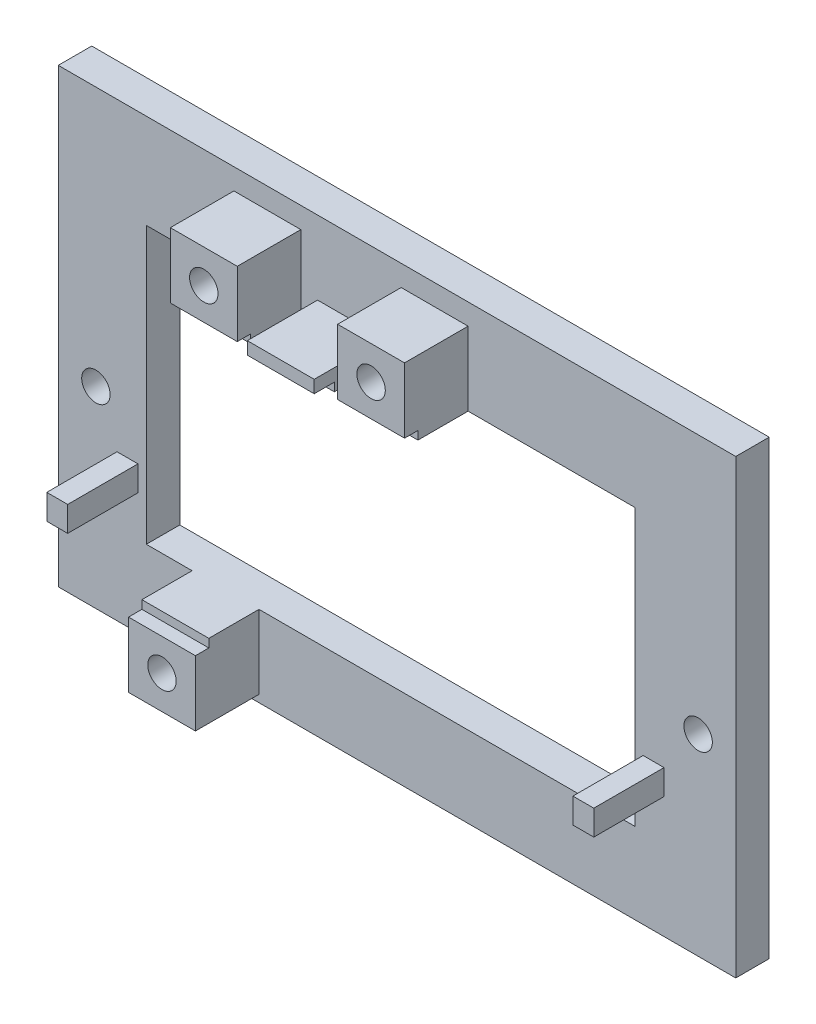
ISO-10303-21;
HEADER;
FILE_DESCRIPTION(('STEP AP214'),'2;1');
FILE_NAME('part.step','',(''),(''),'','','');
FILE_SCHEMA(('AUTOMOTIVE_DESIGN { 1 0 10303 214 1 1 1 1 }'));
ENDSEC;
DATA;
#1=APPLICATION_CONTEXT('core data for automotive mechanical design processes');
#2=APPLICATION_PROTOCOL_DEFINITION('international standard','automotive_design',2000,#1);
#3=PRODUCT_CONTEXT('',#1,'mechanical');
#4=PRODUCT('Part','Part','',(#3));
#5=PRODUCT_RELATED_PRODUCT_CATEGORY('part','',(#4));
#6=PRODUCT_DEFINITION_FORMATION('','',#4);
#7=PRODUCT_DEFINITION_CONTEXT('part definition',#1,'design');
#8=PRODUCT_DEFINITION('design','',#6,#7);
#9=PRODUCT_DEFINITION_SHAPE('','',#8);
#10=(LENGTH_UNIT() NAMED_UNIT(*) SI_UNIT(.MILLI.,.METRE.));
#11=(NAMED_UNIT(*) PLANE_ANGLE_UNIT() SI_UNIT($,.RADIAN.));
#12=(NAMED_UNIT(*) SI_UNIT($,.STERADIAN.) SOLID_ANGLE_UNIT());
#13=UNCERTAINTY_MEASURE_WITH_UNIT(LENGTH_MEASURE(1.E-05),#10,'distance_accuracy_value','');
#14=(GEOMETRIC_REPRESENTATION_CONTEXT(3) GLOBAL_UNCERTAINTY_ASSIGNED_CONTEXT((#13)) GLOBAL_UNIT_ASSIGNED_CONTEXT((#10,
#11,#12)) REPRESENTATION_CONTEXT('',''));
#15=CARTESIAN_POINT('',(0.,0.,0.));
#16=DIRECTION('',(0.,0.,1.));
#17=DIRECTION('',(1.,0.,0.));
#18=AXIS2_PLACEMENT_3D('',#15,#16,#17);
#19=CARTESIAN_POINT('',(0.,0.,4.));
#20=DIRECTION('',(0.,0.,1.));
#21=DIRECTION('',(1.,0.,0.));
#22=AXIS2_PLACEMENT_3D('',#19,#20,#21);
#23=PLANE('',#22);
#24=DIRECTION('',(0.,-1.,0.));
#25=VECTOR('',#24,1.);
#26=CARTESIAN_POINT('',(-19.,-9.32800108,4.));
#27=LINE('',#26,#25);
#28=CARTESIAN_POINT('',(-19.,-9.32800108,4.));
#29=VERTEX_POINT('',#28);
#30=CARTESIAN_POINT('',(-19.,-18.12800108,4.));
#31=VERTEX_POINT('',#30);
#32=EDGE_CURVE('E479',#29,#31,#27,.T.);
#33=ORIENTED_EDGE('',*,*,#32,.F.);
#34=DIRECTION('',(1.,0.,0.));
#35=VECTOR('',#34,1.);
#36=CARTESIAN_POINT('',(-24.473,-9.32800108,4.));
#37=LINE('',#36,#35);
#38=CARTESIAN_POINT('',(-24.473,-9.32800108,4.));
#39=VERTEX_POINT('',#38);
#40=EDGE_CURVE('E579',#39,#29,#37,.T.);
#41=ORIENTED_EDGE('',*,*,#40,.F.);
#42=DIRECTION('',(0.,-1.,0.));
#43=VECTOR('',#42,1.);
#44=CARTESIAN_POINT('',(-24.473,23.69100004,4.));
#45=LINE('',#44,#43);
#46=CARTESIAN_POINT('',(-24.473,23.69100004,4.));
#47=VERTEX_POINT('',#46);
#48=EDGE_CURVE('E575',#47,#39,#45,.T.);
#49=ORIENTED_EDGE('',*,*,#48,.F.);
#50=DIRECTION('',(-1.,0.,0.));
#51=VECTOR('',#50,1.);
#52=CARTESIAN_POINT('',(33.92699938,23.69100004,4.));
#53=LINE('',#52,#51);
#54=CARTESIAN_POINT('',(-14.,23.69100004,4.));
#55=VERTEX_POINT('',#54);
#56=EDGE_CURVE('E585',#55,#47,#53,.T.);
#57=ORIENTED_EDGE('',*,*,#56,.F.);
#58=DIRECTION('',(0.,-1.,0.));
#59=VECTOR('',#58,1.);
#60=CARTESIAN_POINT('',(-14.,32.49100004,4.));
#61=LINE('',#60,#59);
#62=CARTESIAN_POINT('',(-14.,32.49100004,4.));
#63=VERTEX_POINT('',#62);
#64=EDGE_CURVE('E470',#63,#55,#61,.T.);
#65=ORIENTED_EDGE('',*,*,#64,.F.);
#66=DIRECTION('',(-1.,0.,0.));
#67=VECTOR('',#66,1.);
#68=CARTESIAN_POINT('',(-6.,32.49100004,4.));
#69=LINE('',#68,#67);
#70=CARTESIAN_POINT('',(-6.,32.49100004,4.));
#71=VERTEX_POINT('',#70);
#72=EDGE_CURVE('E530',#71,#63,#69,.T.);
#73=ORIENTED_EDGE('',*,*,#72,.F.);
#74=DIRECTION('',(0.,1.,0.));
#75=VECTOR('',#74,1.);
#76=CARTESIAN_POINT('',(-6.,23.69100004,4.));
#77=LINE('',#76,#75);
#78=CARTESIAN_POINT('',(-6.,23.69100004,4.));
#79=VERTEX_POINT('',#78);
#80=EDGE_CURVE('E537',#79,#71,#77,.T.);
#81=ORIENTED_EDGE('',*,*,#80,.F.);
#82=CARTESIAN_POINT('',(-4.,23.69100004,4.));
#83=VERTEX_POINT('',#82);
#84=EDGE_CURVE('E1154',#83,#79,#53,.T.);
#85=ORIENTED_EDGE('',*,*,#84,.F.);
#86=DIRECTION('',(0.,-1.,0.));
#87=VECTOR('',#86,1.);
#88=CARTESIAN_POINT('',(-4.,26.19100004,4.));
#89=LINE('',#88,#87);
#90=CARTESIAN_POINT('',(-4.,26.19100004,4.));
#91=VERTEX_POINT('',#90);
#92=EDGE_CURVE('E450',#91,#83,#89,.T.);
#93=ORIENTED_EDGE('',*,*,#92,.F.);
#94=DIRECTION('',(-1.,0.,0.));
#95=VECTOR('',#94,1.);
#96=CARTESIAN_POINT('',(4.,26.19100004,4.));
#97=LINE('',#96,#95);
#98=CARTESIAN_POINT('',(4.,26.19100004,4.));
#99=VERTEX_POINT('',#98);
#100=EDGE_CURVE('E489',#99,#91,#97,.T.);
#101=ORIENTED_EDGE('',*,*,#100,.F.);
#102=DIRECTION('',(0.,1.,0.));
#103=VECTOR('',#102,1.);
#104=CARTESIAN_POINT('',(4.,23.69100004,4.));
#105=LINE('',#104,#103);
#106=CARTESIAN_POINT('',(4.,23.69100004,4.));
#107=VERTEX_POINT('',#106);
#108=EDGE_CURVE('E492',#107,#99,#105,.T.);
#109=ORIENTED_EDGE('',*,*,#108,.F.);
#110=CARTESIAN_POINT('',(6.,23.69100004,4.));
#111=VERTEX_POINT('',#110);
#112=EDGE_CURVE('E590',#111,#107,#53,.T.);
#113=ORIENTED_EDGE('',*,*,#112,.F.);
#114=DIRECTION('',(0.,-1.,0.));
#115=VECTOR('',#114,1.);
#116=CARTESIAN_POINT('',(6.,32.49100004,4.));
#117=LINE('',#116,#115);
#118=CARTESIAN_POINT('',(6.,32.49100004,4.));
#119=VERTEX_POINT('',#118);
#120=EDGE_CURVE('E467',#119,#111,#117,.T.);
#121=ORIENTED_EDGE('',*,*,#120,.F.);
#122=DIRECTION('',(-1.,0.,0.));
#123=VECTOR('',#122,1.);
#124=CARTESIAN_POINT('',(14.,32.49100004,4.));
#125=LINE('',#124,#123);
#126=CARTESIAN_POINT('',(14.,32.49100004,4.));
#127=VERTEX_POINT('',#126);
#128=EDGE_CURVE('E460',#127,#119,#125,.T.);
#129=ORIENTED_EDGE('',*,*,#128,.F.);
#130=DIRECTION('',(0.,1.,0.));
#131=VECTOR('',#130,1.);
#132=CARTESIAN_POINT('',(14.,23.69100004,4.));
#133=LINE('',#132,#131);
#134=CARTESIAN_POINT('',(14.,23.69100004,4.));
#135=VERTEX_POINT('',#134);
#136=EDGE_CURVE('E463',#135,#127,#133,.T.);
#137=ORIENTED_EDGE('',*,*,#136,.F.);
#138=CARTESIAN_POINT('',(33.92699938,23.69100004,4.));
#139=VERTEX_POINT('',#138);
#140=EDGE_CURVE('E586',#139,#135,#53,.T.);
#141=ORIENTED_EDGE('',*,*,#140,.F.);
#142=DIRECTION('',(0.,1.,0.));
#143=VECTOR('',#142,1.);
#144=CARTESIAN_POINT('',(33.92699938,-9.32800108,4.));
#145=LINE('',#144,#143);
#146=CARTESIAN_POINT('',(33.92699938,-9.32800108,4.));
#147=VERTEX_POINT('',#146);
#148=EDGE_CURVE('E582',#147,#139,#145,.T.);
#149=ORIENTED_EDGE('',*,*,#148,.F.);
#150=CARTESIAN_POINT('',(-11.,-9.32800108,4.));
#151=VERTEX_POINT('',#150);
#152=EDGE_CURVE('E577',#151,#147,#37,.T.);
#153=ORIENTED_EDGE('',*,*,#152,.F.);
#154=DIRECTION('',(0.,1.,0.));
#155=VECTOR('',#154,1.);
#156=CARTESIAN_POINT('',(-11.,-18.12800108,4.));
#157=LINE('',#156,#155);
#158=CARTESIAN_POINT('',(-11.,-18.12800108,4.));
#159=VERTEX_POINT('',#158);
#160=EDGE_CURVE('E514',#159,#151,#157,.T.);
#161=ORIENTED_EDGE('',*,*,#160,.F.);
#162=DIRECTION('',(1.,0.,0.));
#163=VECTOR('',#162,1.);
#164=CARTESIAN_POINT('',(-19.,-18.12800108,4.));
#165=LINE('',#164,#163);
#166=EDGE_CURVE('E517',#31,#159,#165,.T.);
#167=ORIENTED_EDGE('',*,*,#166,.F.);
#168=EDGE_LOOP('',(#33,#41,#49,#57,#65,#73,#81,#85,#93,#101,#109,#113,#121,#129,#137,#141,#149,
#153,#161,#167));
#169=FACE_BOUND('',#168,.T.);
#170=CARTESIAN_POINT('',(41.5,4.,4.));
#171=DIRECTION('',(0.,0.,1.));
#172=DIRECTION('',(1.,0.,0.));
#173=AXIS2_PLACEMENT_3D('',#170,#171,#172);
#174=CIRCLE('',#173,1.7);
#175=CARTESIAN_POINT('',(43.2,4.,4.));
#176=VERTEX_POINT('',#175);
#177=EDGE_CURVE('E563',#176,#176,#174,.T.);
#178=ORIENTED_EDGE('',*,*,#177,.F.);
#179=EDGE_LOOP('',(#178));
#180=FACE_BOUND('',#179,.T.);
#181=DIRECTION('',(0.,-1.,0.));
#182=VECTOR('',#181,1.);
#183=CARTESIAN_POINT('',(-35.,35.,4.));
#184=LINE('',#183,#182);
#185=CARTESIAN_POINT('',(-35.,35.,4.));
#186=VERTEX_POINT('',#185);
#187=CARTESIAN_POINT('',(-35.,-19.,4.));
#188=VERTEX_POINT('',#187);
#189=EDGE_CURVE('E611',#186,#188,#184,.T.);
#190=ORIENTED_EDGE('',*,*,#189,.T.);
#191=DIRECTION('',(1.,0.,0.));
#192=VECTOR('',#191,1.);
#193=CARTESIAN_POINT('',(-35.,-19.,4.));
#194=LINE('',#193,#192);
#195=CARTESIAN_POINT('',(46.,-19.,4.));
#196=VERTEX_POINT('',#195);
#197=EDGE_CURVE('E614',#188,#196,#194,.T.);
#198=ORIENTED_EDGE('',*,*,#197,.T.);
#199=DIRECTION('',(0.,1.,0.));
#200=VECTOR('',#199,1.);
#201=CARTESIAN_POINT('',(46.,-19.,4.));
#202=LINE('',#201,#200);
#203=CARTESIAN_POINT('',(46.,35.,4.));
#204=VERTEX_POINT('',#203);
#205=EDGE_CURVE('E617',#196,#204,#202,.T.);
#206=ORIENTED_EDGE('',*,*,#205,.T.);
#207=DIRECTION('',(-1.,0.,0.));
#208=VECTOR('',#207,1.);
#209=CARTESIAN_POINT('',(46.,35.,4.));
#210=LINE('',#209,#208);
#211=EDGE_CURVE('E619',#204,#186,#210,.T.);
#212=ORIENTED_EDGE('',*,*,#211,.T.);
#213=EDGE_LOOP('',(#190,#198,#206,#212));
#214=FACE_BOUND('',#213,.T.);
#215=CARTESIAN_POINT('',(-30.5,4.,4.));
#216=DIRECTION('',(0.,0.,1.));
#217=DIRECTION('',(1.,0.,0.));
#218=AXIS2_PLACEMENT_3D('',#215,#216,#217);
#219=CIRCLE('',#218,1.7);
#220=CARTESIAN_POINT('',(-28.8,4.,4.));
#221=VERTEX_POINT('',#220);
#222=EDGE_CURVE('E569',#221,#221,#219,.T.);
#223=ORIENTED_EDGE('',*,*,#222,.F.);
#224=EDGE_LOOP('',(#223));
#225=FACE_BOUND('',#224,.T.);
#226=DIRECTION('',(1.,0.,0.));
#227=VECTOR('',#226,1.);
#228=CARTESIAN_POINT('',(34.92699938,-4.5,4.));
#229=LINE('',#228,#227);
#230=CARTESIAN_POINT('',(34.92699938,-4.5,4.));
#231=VERTEX_POINT('',#230);
#232=CARTESIAN_POINT('',(37.42699938,-4.5,4.));
#233=VERTEX_POINT('',#232);
#234=EDGE_CURVE('E349',#231,#233,#229,.T.);
#235=ORIENTED_EDGE('',*,*,#234,.F.);
#236=DIRECTION('',(0.,-1.,0.));
#237=VECTOR('',#236,1.);
#238=CARTESIAN_POINT('',(34.92699938,-1.5,4.));
#239=LINE('',#238,#237);
#240=CARTESIAN_POINT('',(34.92699938,-1.5,4.));
#241=VERTEX_POINT('',#240);
#242=EDGE_CURVE('E351',#241,#231,#239,.T.);
#243=ORIENTED_EDGE('',*,*,#242,.F.);
#244=DIRECTION('',(-1.,0.,0.));
#245=VECTOR('',#244,1.);
#246=CARTESIAN_POINT('',(37.42699938,-1.5,4.));
#247=LINE('',#246,#245);
#248=CARTESIAN_POINT('',(37.42699938,-1.5,4.));
#249=VERTEX_POINT('',#248);
#250=EDGE_CURVE('E344',#249,#241,#247,.T.);
#251=ORIENTED_EDGE('',*,*,#250,.F.);
#252=DIRECTION('',(0.,1.,0.));
#253=VECTOR('',#252,1.);
#254=CARTESIAN_POINT('',(37.42699938,-4.5,4.));
#255=LINE('',#254,#253);
#256=EDGE_CURVE('E346',#233,#249,#255,.T.);
#257=ORIENTED_EDGE('',*,*,#256,.F.);
#258=EDGE_LOOP('',(#235,#243,#251,#257));
#259=FACE_BOUND('',#258,.T.);
#260=DIRECTION('',(1.,0.,0.));
#261=VECTOR('',#260,1.);
#262=CARTESIAN_POINT('',(-27.973,-4.5,4.));
#263=LINE('',#262,#261);
#264=CARTESIAN_POINT('',(-27.973,-4.5,4.));
#265=VERTEX_POINT('',#264);
#266=CARTESIAN_POINT('',(-25.473,-4.5,4.));
#267=VERTEX_POINT('',#266);
#268=EDGE_CURVE('E1260',#265,#267,#263,.T.);
#269=ORIENTED_EDGE('',*,*,#268,.F.);
#270=DIRECTION('',(0.,-1.,0.));
#271=VECTOR('',#270,1.);
#272=CARTESIAN_POINT('',(-27.973,-1.5,4.));
#273=LINE('',#272,#271);
#274=CARTESIAN_POINT('',(-27.973,-1.5,4.));
#275=VERTEX_POINT('',#274);
#276=EDGE_CURVE('E324',#275,#265,#273,.T.);
#277=ORIENTED_EDGE('',*,*,#276,.F.);
#278=DIRECTION('',(-1.,0.,0.));
#279=VECTOR('',#278,1.);
#280=CARTESIAN_POINT('',(-25.473,-1.5,4.));
#281=LINE('',#280,#279);
#282=CARTESIAN_POINT('',(-25.473,-1.5,4.));
#283=VERTEX_POINT('',#282);
#284=EDGE_CURVE('E320',#283,#275,#281,.T.);
#285=ORIENTED_EDGE('',*,*,#284,.F.);
#286=DIRECTION('',(0.,1.,0.));
#287=VECTOR('',#286,1.);
#288=CARTESIAN_POINT('',(-25.473,-4.5,4.));
#289=LINE('',#288,#287);
#290=EDGE_CURVE('E1257',#267,#283,#289,.T.);
#291=ORIENTED_EDGE('',*,*,#290,.F.);
#292=EDGE_LOOP('',(#269,#277,#285,#291));
#293=FACE_BOUND('',#292,.T.);
#294=ADVANCED_FACE('F43',(#169,#180,#214,#225,#259,#293),#23,.T.);
#295=CARTESIAN_POINT('',(0.,0.,10.));
#296=DIRECTION('',(0.,0.,1.));
#297=DIRECTION('',(1.,0.,0.));
#298=AXIS2_PLACEMENT_3D('',#295,#296,#297);
#299=PLANE('',#298);
#300=DIRECTION('',(0.,1.,0.));
#301=VECTOR('',#300,1.);
#302=CARTESIAN_POINT('',(4.,23.69100004,10.));
#303=LINE('',#302,#301);
#304=CARTESIAN_POINT('',(4.,23.69100004,10.));
#305=VERTEX_POINT('',#304);
#306=CARTESIAN_POINT('',(4.,24.69100004,10.));
#307=VERTEX_POINT('',#306);
#308=EDGE_CURVE('E488',#305,#307,#303,.T.);
#309=ORIENTED_EDGE('',*,*,#308,.T.);
#310=DIRECTION('',(1.,0.,0.));
#311=VECTOR('',#310,1.);
#312=CARTESIAN_POINT('',(-4.,24.69100004,10.));
#313=LINE('',#312,#311);
#314=CARTESIAN_POINT('',(-4.,24.69100004,10.));
#315=VERTEX_POINT('',#314);
#316=EDGE_CURVE('E326',#315,#307,#313,.T.);
#317=ORIENTED_EDGE('',*,*,#316,.F.);
#318=DIRECTION('',(0.,-1.,0.));
#319=VECTOR('',#318,1.);
#320=CARTESIAN_POINT('',(-4.,26.19100004,10.));
#321=LINE('',#320,#319);
#322=CARTESIAN_POINT('',(-4.,23.69100004,10.));
#323=VERTEX_POINT('',#322);
#324=EDGE_CURVE('E493',#315,#323,#321,.T.);
#325=ORIENTED_EDGE('',*,*,#324,.T.);
#326=DIRECTION('',(1.,0.,0.));
#327=VECTOR('',#326,1.);
#328=CARTESIAN_POINT('',(-4.,23.69100004,10.));
#329=LINE('',#328,#327);
#330=EDGE_CURVE('E499',#323,#305,#329,.T.);
#331=ORIENTED_EDGE('',*,*,#330,.T.);
#332=EDGE_LOOP('',(#309,#317,#325,#331));
#333=FACE_BOUND('',#332,.T.);
#334=ADVANCED_FACE('F663',(#333),#299,.T.);
#335=CARTESIAN_POINT('',(0.,0.,10.));
#336=DIRECTION('',(0.,0.,1.));
#337=DIRECTION('',(1.,0.,0.));
#338=AXIS2_PLACEMENT_3D('',#335,#336,#337);
#339=PLANE('',#338);
#340=DIRECTION('',(0.,1.,0.));
#341=VECTOR('',#340,1.);
#342=CARTESIAN_POINT('',(-6.,23.69100004,10.));
#343=LINE('',#342,#341);
#344=CARTESIAN_POINT('',(-6.,23.69100004,10.));
#345=VERTEX_POINT('',#344);
#346=CARTESIAN_POINT('',(-6.,24.69100004,10.));
#347=VERTEX_POINT('',#346);
#348=EDGE_CURVE('E532',#345,#347,#343,.T.);
#349=ORIENTED_EDGE('',*,*,#348,.T.);
#350=DIRECTION('',(1.,0.,0.));
#351=VECTOR('',#350,1.);
#352=CARTESIAN_POINT('',(-14.,24.69100004,10.));
#353=LINE('',#352,#351);
#354=CARTESIAN_POINT('',(-14.,24.69100004,10.));
#355=VERTEX_POINT('',#354);
#356=EDGE_CURVE('E425',#355,#347,#353,.T.);
#357=ORIENTED_EDGE('',*,*,#356,.F.);
#358=DIRECTION('',(0.,-1.,0.));
#359=VECTOR('',#358,1.);
#360=CARTESIAN_POINT('',(-14.,32.49100004,10.));
#361=LINE('',#360,#359);
#362=CARTESIAN_POINT('',(-14.,23.69100004,10.));
#363=VERTEX_POINT('',#362);
#364=EDGE_CURVE('E527',#355,#363,#361,.T.);
#365=ORIENTED_EDGE('',*,*,#364,.T.);
#366=DIRECTION('',(1.,0.,0.));
#367=VECTOR('',#366,1.);
#368=CARTESIAN_POINT('',(-14.,23.69100004,10.));
#369=LINE('',#368,#367);
#370=EDGE_CURVE('E529',#363,#345,#369,.T.);
#371=ORIENTED_EDGE('',*,*,#370,.T.);
#372=EDGE_LOOP('',(#349,#357,#365,#371));
#373=FACE_BOUND('',#372,.T.);
#374=ADVANCED_FACE('F671',(#373),#339,.T.);
#375=CARTESIAN_POINT('',(0.,0.,10.));
#376=DIRECTION('',(0.,0.,1.));
#377=DIRECTION('',(1.,0.,0.));
#378=AXIS2_PLACEMENT_3D('',#375,#376,#377);
#379=PLANE('',#378);
#380=DIRECTION('',(0.,1.,0.));
#381=VECTOR('',#380,1.);
#382=CARTESIAN_POINT('',(14.,23.69100004,10.));
#383=LINE('',#382,#381);
#384=CARTESIAN_POINT('',(14.,23.69100004,10.));
#385=VERTEX_POINT('',#384);
#386=CARTESIAN_POINT('',(14.,24.69100004,10.));
#387=VERTEX_POINT('',#386);
#388=EDGE_CURVE('E459',#385,#387,#383,.T.);
#389=ORIENTED_EDGE('',*,*,#388,.T.);
#390=DIRECTION('',(1.,0.,0.));
#391=VECTOR('',#390,1.);
#392=CARTESIAN_POINT('',(6.,24.69100004,10.));
#393=LINE('',#392,#391);
#394=CARTESIAN_POINT('',(6.,24.69100004,10.));
#395=VERTEX_POINT('',#394);
#396=EDGE_CURVE('E386',#395,#387,#393,.T.);
#397=ORIENTED_EDGE('',*,*,#396,.F.);
#398=DIRECTION('',(0.,-1.,0.));
#399=VECTOR('',#398,1.);
#400=CARTESIAN_POINT('',(6.,32.49100004,10.));
#401=LINE('',#400,#399);
#402=CARTESIAN_POINT('',(6.,23.69100004,10.));
#403=VERTEX_POINT('',#402);
#404=EDGE_CURVE('E464',#395,#403,#401,.T.);
#405=ORIENTED_EDGE('',*,*,#404,.T.);
#406=DIRECTION('',(1.,0.,0.));
#407=VECTOR('',#406,1.);
#408=CARTESIAN_POINT('',(6.,23.69100004,10.));
#409=LINE('',#408,#407);
#410=EDGE_CURVE('E472',#403,#385,#409,.T.);
#411=ORIENTED_EDGE('',*,*,#410,.T.);
#412=EDGE_LOOP('',(#389,#397,#405,#411));
#413=FACE_BOUND('',#412,.T.);
#414=ADVANCED_FACE('F681',(#413),#379,.T.);
#415=CARTESIAN_POINT('',(0.,0.,0.));
#416=DIRECTION('',(0.,0.,1.));
#417=DIRECTION('',(1.,0.,0.));
#418=AXIS2_PLACEMENT_3D('',#415,#416,#417);
#419=PLANE('',#418);
#420=DIRECTION('',(0.,-1.,0.));
#421=VECTOR('',#420,1.);
#422=CARTESIAN_POINT('',(-35.,35.,0.));
#423=LINE('',#422,#421);
#424=CARTESIAN_POINT('',(-35.,35.,0.));
#425=VERTEX_POINT('',#424);
#426=CARTESIAN_POINT('',(-35.,-19.,0.));
#427=VERTEX_POINT('',#426);
#428=EDGE_CURVE('E610',#425,#427,#423,.T.);
#429=ORIENTED_EDGE('',*,*,#428,.F.);
#430=DIRECTION('',(-1.,0.,0.));
#431=VECTOR('',#430,1.);
#432=CARTESIAN_POINT('',(46.,35.,0.));
#433=LINE('',#432,#431);
#434=CARTESIAN_POINT('',(46.,35.,0.));
#435=VERTEX_POINT('',#434);
#436=EDGE_CURVE('E615',#435,#425,#433,.T.);
#437=ORIENTED_EDGE('',*,*,#436,.F.);
#438=DIRECTION('',(0.,1.,0.));
#439=VECTOR('',#438,1.);
#440=CARTESIAN_POINT('',(46.,-19.,0.));
#441=LINE('',#440,#439);
#442=CARTESIAN_POINT('',(46.,-19.,0.));
#443=VERTEX_POINT('',#442);
#444=EDGE_CURVE('E626',#443,#435,#441,.T.);
#445=ORIENTED_EDGE('',*,*,#444,.F.);
#446=DIRECTION('',(1.,0.,0.));
#447=VECTOR('',#446,1.);
#448=CARTESIAN_POINT('',(-35.,-19.,0.));
#449=LINE('',#448,#447);
#450=EDGE_CURVE('E624',#427,#443,#449,.T.);
#451=ORIENTED_EDGE('',*,*,#450,.F.);
#452=EDGE_LOOP('',(#429,#437,#445,#451));
#453=FACE_BOUND('',#452,.T.);
#454=DIRECTION('',(0.,-1.,0.));
#455=VECTOR('',#454,1.);
#456=CARTESIAN_POINT('',(-24.473,23.69100004,0.));
#457=LINE('',#456,#455);
#458=CARTESIAN_POINT('',(-24.473,23.69100004,0.));
#459=VERTEX_POINT('',#458);
#460=CARTESIAN_POINT('',(-24.473,-9.32800108,0.));
#461=VERTEX_POINT('',#460);
#462=EDGE_CURVE('E572',#459,#461,#457,.T.);
#463=ORIENTED_EDGE('',*,*,#462,.T.);
#464=DIRECTION('',(1.,0.,0.));
#465=VECTOR('',#464,1.);
#466=CARTESIAN_POINT('',(-24.473,-9.32800108,0.));
#467=LINE('',#466,#465);
#468=CARTESIAN_POINT('',(33.92699938,-9.32800108,0.));
#469=VERTEX_POINT('',#468);
#470=EDGE_CURVE('E593',#461,#469,#467,.T.);
#471=ORIENTED_EDGE('',*,*,#470,.T.);
#472=DIRECTION('',(0.,1.,0.));
#473=VECTOR('',#472,1.);
#474=CARTESIAN_POINT('',(33.92699938,-9.32800108,0.));
#475=LINE('',#474,#473);
#476=CARTESIAN_POINT('',(33.92699938,23.69100004,0.));
#477=VERTEX_POINT('',#476);
#478=EDGE_CURVE('E596',#469,#477,#475,.T.);
#479=ORIENTED_EDGE('',*,*,#478,.T.);
#480=DIRECTION('',(-1.,0.,0.));
#481=VECTOR('',#480,1.);
#482=CARTESIAN_POINT('',(33.92699938,23.69100004,0.));
#483=LINE('',#482,#481);
#484=EDGE_CURVE('E578',#477,#459,#483,.T.);
#485=ORIENTED_EDGE('',*,*,#484,.T.);
#486=EDGE_LOOP('',(#463,#471,#479,#485));
#487=FACE_BOUND('',#486,.T.);
#488=CARTESIAN_POINT('',(-30.5,4.,0.));
#489=DIRECTION('',(0.,0.,1.));
#490=DIRECTION('',(1.,0.,0.));
#491=AXIS2_PLACEMENT_3D('',#488,#489,#490);
#492=CIRCLE('',#491,1.7);
#493=CARTESIAN_POINT('',(-28.8,4.,0.));
#494=VERTEX_POINT('',#493);
#495=EDGE_CURVE('E566',#494,#494,#492,.T.);
#496=ORIENTED_EDGE('',*,*,#495,.T.);
#497=EDGE_LOOP('',(#496));
#498=FACE_BOUND('',#497,.T.);
#499=CARTESIAN_POINT('',(41.5,4.,0.));
#500=DIRECTION('',(0.,0.,1.));
#501=DIRECTION('',(1.,0.,0.));
#502=AXIS2_PLACEMENT_3D('',#499,#500,#501);
#503=CIRCLE('',#502,1.7);
#504=CARTESIAN_POINT('',(43.2,4.,0.));
#505=VERTEX_POINT('',#504);
#506=EDGE_CURVE('E562',#505,#505,#503,.T.);
#507=ORIENTED_EDGE('',*,*,#506,.T.);
#508=EDGE_LOOP('',(#507));
#509=FACE_BOUND('',#508,.T.);
#510=CARTESIAN_POINT('',(-10.,28.49100004,0.));
#511=DIRECTION('',(0.,0.,1.));
#512=DIRECTION('',(1.,0.,0.));
#513=AXIS2_PLACEMENT_3D('',#510,#511,#512);
#514=CIRCLE('',#513,1.7);
#515=CARTESIAN_POINT('',(-8.3,28.49100004,0.));
#516=VERTEX_POINT('',#515);
#517=EDGE_CURVE('E559',#516,#516,#514,.T.);
#518=ORIENTED_EDGE('',*,*,#517,.T.);
#519=EDGE_LOOP('',(#518));
#520=FACE_BOUND('',#519,.T.);
#521=CARTESIAN_POINT('',(10.,28.49100004,0.));
#522=DIRECTION('',(0.,0.,1.));
#523=DIRECTION('',(1.,0.,0.));
#524=AXIS2_PLACEMENT_3D('',#521,#522,#523);
#525=CIRCLE('',#524,1.7);
#526=CARTESIAN_POINT('',(11.7,28.49100004,0.));
#527=VERTEX_POINT('',#526);
#528=EDGE_CURVE('E556',#527,#527,#525,.T.);
#529=ORIENTED_EDGE('',*,*,#528,.T.);
#530=EDGE_LOOP('',(#529));
#531=FACE_BOUND('',#530,.T.);
#532=CARTESIAN_POINT('',(-15.,-14.12800108,0.));
#533=DIRECTION('',(0.,0.,1.));
#534=DIRECTION('',(1.,0.,0.));
#535=AXIS2_PLACEMENT_3D('',#532,#533,#534);
#536=CIRCLE('',#535,1.7);
#537=CARTESIAN_POINT('',(-13.3,-14.12800108,0.));
#538=VERTEX_POINT('',#537);
#539=EDGE_CURVE('E553',#538,#538,#536,.T.);
#540=ORIENTED_EDGE('',*,*,#539,.T.);
#541=EDGE_LOOP('',(#540));
#542=FACE_BOUND('',#541,.T.);
#543=ADVANCED_FACE('F644',(#453,#487,#498,#509,#520,#531,#542),#419,.F.);
#544=CARTESIAN_POINT('',(-35.,35.,4.));
#545=DIRECTION('',(1.,0.,0.));
#546=DIRECTION('',(0.,0.,-1.));
#547=AXIS2_PLACEMENT_3D('',#544,#545,#546);
#548=PLANE('',#547);
#549=ORIENTED_EDGE('',*,*,#428,.T.);
#550=DIRECTION('',(0.,0.,-1.));
#551=VECTOR('',#550,1.);
#552=CARTESIAN_POINT('',(-35.,-19.,4.));
#553=LINE('',#552,#551);
#554=EDGE_CURVE('E11',#188,#427,#553,.T.);
#555=ORIENTED_EDGE('',*,*,#554,.F.);
#556=ORIENTED_EDGE('',*,*,#189,.F.);
#557=DIRECTION('',(0.,0.,-1.));
#558=VECTOR('',#557,1.);
#559=CARTESIAN_POINT('',(-35.,35.,4.));
#560=LINE('',#559,#558);
#561=EDGE_CURVE('E621',#186,#425,#560,.T.);
#562=ORIENTED_EDGE('',*,*,#561,.T.);
#563=EDGE_LOOP('',(#549,#555,#556,#562));
#564=FACE_BOUND('',#563,.T.);
#565=ADVANCED_FACE('F45',(#564),#548,.F.);
#566=CARTESIAN_POINT('',(-35.,-19.,4.));
#567=DIRECTION('',(0.,1.,0.));
#568=DIRECTION('',(0.,0.,1.));
#569=AXIS2_PLACEMENT_3D('',#566,#567,#568);
#570=PLANE('',#569);
#571=ORIENTED_EDGE('',*,*,#450,.T.);
#572=DIRECTION('',(0.,0.,-1.));
#573=VECTOR('',#572,1.);
#574=CARTESIAN_POINT('',(46.,-19.,4.));
#575=LINE('',#574,#573);
#576=EDGE_CURVE('E51',#196,#443,#575,.T.);
#577=ORIENTED_EDGE('',*,*,#576,.F.);
#578=ORIENTED_EDGE('',*,*,#197,.F.);
#579=ORIENTED_EDGE('',*,*,#554,.T.);
#580=EDGE_LOOP('',(#571,#577,#578,#579));
#581=FACE_BOUND('',#580,.T.);
#582=ADVANCED_FACE('F655',(#581),#570,.F.);
#583=CARTESIAN_POINT('',(46.,-19.,4.));
#584=DIRECTION('',(-1.,0.,0.));
#585=DIRECTION('',(0.,0.,1.));
#586=AXIS2_PLACEMENT_3D('',#583,#584,#585);
#587=PLANE('',#586);
#588=ORIENTED_EDGE('',*,*,#444,.T.);
#589=DIRECTION('',(0.,0.,-1.));
#590=VECTOR('',#589,1.);
#591=CARTESIAN_POINT('',(46.,35.,4.));
#592=LINE('',#591,#590);
#593=EDGE_CURVE('E631',#204,#435,#592,.T.);
#594=ORIENTED_EDGE('',*,*,#593,.F.);
#595=ORIENTED_EDGE('',*,*,#205,.F.);
#596=ORIENTED_EDGE('',*,*,#576,.T.);
#597=EDGE_LOOP('',(#588,#594,#595,#596));
#598=FACE_BOUND('',#597,.T.);
#599=ADVANCED_FACE('F638',(#598),#587,.F.);
#600=CARTESIAN_POINT('',(46.,35.,4.));
#601=DIRECTION('',(0.,-1.,0.));
#602=DIRECTION('',(0.,0.,-1.));
#603=AXIS2_PLACEMENT_3D('',#600,#601,#602);
#604=PLANE('',#603);
#605=ORIENTED_EDGE('',*,*,#436,.T.);
#606=ORIENTED_EDGE('',*,*,#561,.F.);
#607=ORIENTED_EDGE('',*,*,#211,.F.);
#608=ORIENTED_EDGE('',*,*,#593,.T.);
#609=EDGE_LOOP('',(#605,#606,#607,#608));
#610=FACE_BOUND('',#609,.T.);
#611=ADVANCED_FACE('F648',(#610),#604,.F.);
#612=CARTESIAN_POINT('',(-24.473,23.69100004,4.));
#613=DIRECTION('',(1.,0.,0.));
#614=DIRECTION('',(0.,0.,-1.));
#615=AXIS2_PLACEMENT_3D('',#612,#613,#614);
#616=PLANE('',#615);
#617=ORIENTED_EDGE('',*,*,#462,.F.);
#618=DIRECTION('',(0.,0.,-1.));
#619=VECTOR('',#618,1.);
#620=CARTESIAN_POINT('',(-24.473,23.69100004,4.));
#621=LINE('',#620,#619);
#622=EDGE_CURVE('E589',#47,#459,#621,.T.);
#623=ORIENTED_EDGE('',*,*,#622,.F.);
#624=ORIENTED_EDGE('',*,*,#48,.T.);
#625=DIRECTION('',(0.,0.,-1.));
#626=VECTOR('',#625,1.);
#627=CARTESIAN_POINT('',(-24.473,-9.32800108,4.));
#628=LINE('',#627,#626);
#629=EDGE_CURVE('E607',#39,#461,#628,.T.);
#630=ORIENTED_EDGE('',*,*,#629,.T.);
#631=EDGE_LOOP('',(#617,#623,#624,#630));
#632=FACE_BOUND('',#631,.T.);
#633=ADVANCED_FACE('F677',(#632),#616,.T.);
#634=CARTESIAN_POINT('',(-24.473,-9.32800108,4.));
#635=DIRECTION('',(0.,1.,0.));
#636=DIRECTION('',(0.,0.,1.));
#637=AXIS2_PLACEMENT_3D('',#634,#635,#636);
#638=PLANE('',#637);
#639=ORIENTED_EDGE('',*,*,#470,.F.);
#640=ORIENTED_EDGE('',*,*,#629,.F.);
#641=ORIENTED_EDGE('',*,*,#40,.T.);
#642=DIRECTION('',(0.,0.,-1.));
#643=VECTOR('',#642,1.);
#644=CARTESIAN_POINT('',(-19.,-9.32800108,10.));
#645=LINE('',#644,#643);
#646=CARTESIAN_POINT('',(-19.,-9.32800108,10.));
#647=VERTEX_POINT('',#646);
#648=EDGE_CURVE('E510',#647,#29,#645,.T.);
#649=ORIENTED_EDGE('',*,*,#648,.F.);
#650=DIRECTION('',(-1.,0.,0.));
#651=VECTOR('',#650,1.);
#652=CARTESIAN_POINT('',(-11.,-9.32800108,10.));
#653=LINE('',#652,#651);
#654=CARTESIAN_POINT('',(-11.,-9.32800108,10.));
#655=VERTEX_POINT('',#654);
#656=EDGE_CURVE('E513',#655,#647,#653,.T.);
#657=ORIENTED_EDGE('',*,*,#656,.F.);
#658=DIRECTION('',(0.,0.,-1.));
#659=VECTOR('',#658,1.);
#660=CARTESIAN_POINT('',(-11.,-9.32800108,10.));
#661=LINE('',#660,#659);
#662=EDGE_CURVE('E507',#655,#151,#661,.T.);
#663=ORIENTED_EDGE('',*,*,#662,.T.);
#664=ORIENTED_EDGE('',*,*,#152,.T.);
#665=DIRECTION('',(0.,0.,-1.));
#666=VECTOR('',#665,1.);
#667=CARTESIAN_POINT('',(33.92699938,-9.32800108,4.));
#668=LINE('',#667,#666);
#669=EDGE_CURVE('E605',#147,#469,#668,.T.);
#670=ORIENTED_EDGE('',*,*,#669,.T.);
#671=EDGE_LOOP('',(#639,#640,#641,#649,#657,#663,#664,#670));
#672=FACE_BOUND('',#671,.T.);
#673=ADVANCED_FACE('F686',(#672),#638,.T.);
#674=CARTESIAN_POINT('',(33.92699938,-9.32800108,4.));
#675=DIRECTION('',(-1.,0.,0.));
#676=DIRECTION('',(0.,0.,1.));
#677=AXIS2_PLACEMENT_3D('',#674,#675,#676);
#678=PLANE('',#677);
#679=ORIENTED_EDGE('',*,*,#478,.F.);
#680=ORIENTED_EDGE('',*,*,#669,.F.);
#681=ORIENTED_EDGE('',*,*,#148,.T.);
#682=DIRECTION('',(0.,0.,-1.));
#683=VECTOR('',#682,1.);
#684=CARTESIAN_POINT('',(33.92699938,23.69100004,4.));
#685=LINE('',#684,#683);
#686=EDGE_CURVE('E603',#139,#477,#685,.T.);
#687=ORIENTED_EDGE('',*,*,#686,.T.);
#688=EDGE_LOOP('',(#679,#680,#681,#687));
#689=FACE_BOUND('',#688,.T.);
#690=ADVANCED_FACE('F692',(#689),#678,.T.);
#691=CARTESIAN_POINT('',(33.92699938,23.69100004,4.));
#692=DIRECTION('',(0.,-1.,0.));
#693=DIRECTION('',(0.,0.,-1.));
#694=AXIS2_PLACEMENT_3D('',#691,#692,#693);
#695=PLANE('',#694);
#696=ORIENTED_EDGE('',*,*,#484,.F.);
#697=ORIENTED_EDGE('',*,*,#686,.F.);
#698=ORIENTED_EDGE('',*,*,#140,.T.);
#699=DIRECTION('',(0.,0.,-1.));
#700=VECTOR('',#699,1.);
#701=CARTESIAN_POINT('',(14.,23.69100004,10.));
#702=LINE('',#701,#700);
#703=EDGE_CURVE('E449',#385,#135,#702,.T.);
#704=ORIENTED_EDGE('',*,*,#703,.F.);
#705=ORIENTED_EDGE('',*,*,#410,.F.);
#706=DIRECTION('',(0.,0.,-1.));
#707=VECTOR('',#706,1.);
#708=CARTESIAN_POINT('',(6.,23.69100004,10.));
#709=LINE('',#708,#707);
#710=EDGE_CURVE('E446',#403,#111,#709,.T.);
#711=ORIENTED_EDGE('',*,*,#710,.T.);
#712=ORIENTED_EDGE('',*,*,#112,.T.);
#713=DIRECTION('',(0.,0.,-1.));
#714=VECTOR('',#713,1.);
#715=CARTESIAN_POINT('',(4.,23.69100004,10.));
#716=LINE('',#715,#714);
#717=EDGE_CURVE('E478',#305,#107,#716,.T.);
#718=ORIENTED_EDGE('',*,*,#717,.F.);
#719=ORIENTED_EDGE('',*,*,#330,.F.);
#720=DIRECTION('',(0.,0.,-1.));
#721=VECTOR('',#720,1.);
#722=CARTESIAN_POINT('',(-4.,23.69100004,10.));
#723=LINE('',#722,#721);
#724=EDGE_CURVE('E475',#323,#83,#723,.T.);
#725=ORIENTED_EDGE('',*,*,#724,.T.);
#726=ORIENTED_EDGE('',*,*,#84,.T.);
#727=DIRECTION('',(0.,0.,-1.));
#728=VECTOR('',#727,1.);
#729=CARTESIAN_POINT('',(-6.,23.69100004,10.));
#730=LINE('',#729,#728);
#731=EDGE_CURVE('E547',#345,#79,#730,.T.);
#732=ORIENTED_EDGE('',*,*,#731,.F.);
#733=ORIENTED_EDGE('',*,*,#370,.F.);
#734=DIRECTION('',(0.,0.,-1.));
#735=VECTOR('',#734,1.);
#736=CARTESIAN_POINT('',(-14.,23.69100004,10.));
#737=LINE('',#736,#735);
#738=EDGE_CURVE('E550',#363,#55,#737,.T.);
#739=ORIENTED_EDGE('',*,*,#738,.T.);
#740=ORIENTED_EDGE('',*,*,#56,.T.);
#741=ORIENTED_EDGE('',*,*,#622,.T.);
#742=EDGE_LOOP('',(#696,#697,#698,#704,#705,#711,#712,#718,#719,#725,#726,#732,#733,#739,#740,#741));
#743=FACE_BOUND('',#742,.T.);
#744=ADVANCED_FACE('F699',(#743),#695,.T.);
#745=CARTESIAN_POINT('',(-30.5,4.,4.));
#746=DIRECTION('',(0.,0.,-1.));
#747=DIRECTION('',(-1.,0.,0.));
#748=AXIS2_PLACEMENT_3D('',#745,#746,#747);
#749=CYLINDRICAL_SURFACE('',#748,1.7);
#750=ORIENTED_EDGE('',*,*,#222,.T.);
#751=EDGE_LOOP('',(#750));
#752=FACE_BOUND('',#751,.T.);
#753=ORIENTED_EDGE('',*,*,#495,.F.);
#754=EDGE_LOOP('',(#753));
#755=FACE_BOUND('',#754,.T.);
#756=ADVANCED_FACE('F756',(#752,#755),#749,.F.);
#757=CARTESIAN_POINT('',(41.5,4.,4.));
#758=DIRECTION('',(0.,0.,-1.));
#759=DIRECTION('',(-1.,0.,0.));
#760=AXIS2_PLACEMENT_3D('',#757,#758,#759);
#761=CYLINDRICAL_SURFACE('',#760,1.7);
#762=ORIENTED_EDGE('',*,*,#177,.T.);
#763=EDGE_LOOP('',(#762));
#764=FACE_BOUND('',#763,.T.);
#765=ORIENTED_EDGE('',*,*,#506,.F.);
#766=EDGE_LOOP('',(#765));
#767=FACE_BOUND('',#766,.T.);
#768=ADVANCED_FACE('F748',(#764,#767),#761,.F.);
#769=CARTESIAN_POINT('',(-10.,28.49100004,4.));
#770=DIRECTION('',(0.,0.,-1.));
#771=DIRECTION('',(-1.,0.,0.));
#772=AXIS2_PLACEMENT_3D('',#769,#770,#771);
#773=CYLINDRICAL_SURFACE('',#772,1.7);
#774=ORIENTED_EDGE('',*,*,#517,.F.);
#775=EDGE_LOOP('',(#774));
#776=FACE_BOUND('',#775,.T.);
#777=CARTESIAN_POINT('',(-10.,28.49100004,11.6));
#778=DIRECTION('',(0.,0.,1.));
#779=DIRECTION('',(1.,0.,0.));
#780=AXIS2_PLACEMENT_3D('',#777,#778,#779);
#781=CIRCLE('',#780,1.7);
#782=CARTESIAN_POINT('',(-8.3,28.49100004,11.6));
#783=VERTEX_POINT('',#782);
#784=EDGE_CURVE('E402',#783,#783,#781,.T.);
#785=ORIENTED_EDGE('',*,*,#784,.T.);
#786=EDGE_LOOP('',(#785));
#787=FACE_BOUND('',#786,.T.);
#788=ADVANCED_FACE('F738',(#776,#787),#773,.F.);
#789=CARTESIAN_POINT('',(10.,28.49100004,4.));
#790=DIRECTION('',(0.,0.,-1.));
#791=DIRECTION('',(-1.,0.,0.));
#792=AXIS2_PLACEMENT_3D('',#789,#790,#791);
#793=CYLINDRICAL_SURFACE('',#792,1.7);
#794=ORIENTED_EDGE('',*,*,#528,.F.);
#795=EDGE_LOOP('',(#794));
#796=FACE_BOUND('',#795,.T.);
#797=CARTESIAN_POINT('',(10.,28.49100004,11.6));
#798=DIRECTION('',(0.,0.,1.));
#799=DIRECTION('',(1.,0.,0.));
#800=AXIS2_PLACEMENT_3D('',#797,#798,#799);
#801=CIRCLE('',#800,1.7);
#802=CARTESIAN_POINT('',(11.7,28.49100004,11.6));
#803=VERTEX_POINT('',#802);
#804=EDGE_CURVE('E389',#803,#803,#801,.T.);
#805=ORIENTED_EDGE('',*,*,#804,.T.);
#806=EDGE_LOOP('',(#805));
#807=FACE_BOUND('',#806,.T.);
#808=ADVANCED_FACE('F735',(#796,#807),#793,.F.);
#809=CARTESIAN_POINT('',(-15.,-14.12800108,4.));
#810=DIRECTION('',(0.,0.,-1.));
#811=DIRECTION('',(-1.,0.,0.));
#812=AXIS2_PLACEMENT_3D('',#809,#810,#811);
#813=CYLINDRICAL_SURFACE('',#812,1.7);
#814=ORIENTED_EDGE('',*,*,#539,.F.);
#815=EDGE_LOOP('',(#814));
#816=FACE_BOUND('',#815,.T.);
#817=CARTESIAN_POINT('',(-15.,-14.12800108,11.6));
#818=DIRECTION('',(0.,0.,1.));
#819=DIRECTION('',(1.,0.,0.));
#820=AXIS2_PLACEMENT_3D('',#817,#818,#819);
#821=CIRCLE('',#820,1.7);
#822=CARTESIAN_POINT('',(-13.3,-14.12800108,11.6));
#823=VERTEX_POINT('',#822);
#824=EDGE_CURVE('E382',#823,#823,#821,.T.);
#825=ORIENTED_EDGE('',*,*,#824,.T.);
#826=EDGE_LOOP('',(#825));
#827=FACE_BOUND('',#826,.T.);
#828=ADVANCED_FACE('F737',(#816,#827),#813,.F.);
#829=CARTESIAN_POINT('',(-14.,32.49100004,10.));
#830=DIRECTION('',(1.,0.,0.));
#831=DIRECTION('',(0.,0.,-1.));
#832=AXIS2_PLACEMENT_3D('',#829,#830,#831);
#833=PLANE('',#832);
#834=ORIENTED_EDGE('',*,*,#64,.T.);
#835=ORIENTED_EDGE('',*,*,#738,.F.);
#836=ORIENTED_EDGE('',*,*,#364,.F.);
#837=DIRECTION('',(0.,0.,-1.));
#838=VECTOR('',#837,1.);
#839=CARTESIAN_POINT('',(-14.,24.69100004,11.6));
#840=LINE('',#839,#838);
#841=CARTESIAN_POINT('',(-14.,24.69100004,11.6));
#842=VERTEX_POINT('',#841);
#843=EDGE_CURVE('E442',#842,#355,#840,.T.);
#844=ORIENTED_EDGE('',*,*,#843,.F.);
#845=DIRECTION('',(0.,-1.,0.));
#846=VECTOR('',#845,1.);
#847=CARTESIAN_POINT('',(-14.,32.49100004,11.6));
#848=LINE('',#847,#846);
#849=CARTESIAN_POINT('',(-14.,32.49100004,11.6));
#850=VERTEX_POINT('',#849);
#851=EDGE_CURVE('E426',#850,#842,#848,.T.);
#852=ORIENTED_EDGE('',*,*,#851,.F.);
#853=DIRECTION('',(0.,0.,-1.));
#854=VECTOR('',#853,1.);
#855=CARTESIAN_POINT('',(-14.,32.49100004,10.));
#856=LINE('',#855,#854);
#857=EDGE_CURVE('E534',#850,#63,#856,.T.);
#858=ORIENTED_EDGE('',*,*,#857,.T.);
#859=EDGE_LOOP('',(#834,#835,#836,#844,#852,#858));
#860=FACE_BOUND('',#859,.T.);
#861=ADVANCED_FACE('F745',(#860),#833,.F.);
#862=CARTESIAN_POINT('',(-6.,23.69100004,10.));
#863=DIRECTION('',(-1.,0.,0.));
#864=DIRECTION('',(0.,0.,1.));
#865=AXIS2_PLACEMENT_3D('',#862,#863,#864);
#866=PLANE('',#865);
#867=ORIENTED_EDGE('',*,*,#80,.T.);
#868=DIRECTION('',(0.,0.,-1.));
#869=VECTOR('',#868,1.);
#870=CARTESIAN_POINT('',(-6.,32.49100004,10.));
#871=LINE('',#870,#869);
#872=CARTESIAN_POINT('',(-6.,32.49100004,11.6));
#873=VERTEX_POINT('',#872);
#874=EDGE_CURVE('E544',#873,#71,#871,.T.);
#875=ORIENTED_EDGE('',*,*,#874,.F.);
#876=DIRECTION('',(0.,1.,0.));
#877=VECTOR('',#876,1.);
#878=CARTESIAN_POINT('',(-6.,24.69100004,11.6));
#879=LINE('',#878,#877);
#880=CARTESIAN_POINT('',(-6.,24.69100004,11.6));
#881=VERTEX_POINT('',#880);
#882=EDGE_CURVE('E431',#881,#873,#879,.T.);
#883=ORIENTED_EDGE('',*,*,#882,.F.);
#884=DIRECTION('',(0.,0.,-1.));
#885=VECTOR('',#884,1.);
#886=CARTESIAN_POINT('',(-6.,24.69100004,11.6));
#887=LINE('',#886,#885);
#888=EDGE_CURVE('E437',#881,#347,#887,.T.);
#889=ORIENTED_EDGE('',*,*,#888,.T.);
#890=ORIENTED_EDGE('',*,*,#348,.F.);
#891=ORIENTED_EDGE('',*,*,#731,.T.);
#892=EDGE_LOOP('',(#867,#875,#883,#889,#890,#891));
#893=FACE_BOUND('',#892,.T.);
#894=ADVANCED_FACE('F835',(#893),#866,.F.);
#895=CARTESIAN_POINT('',(-6.,32.49100004,10.));
#896=DIRECTION('',(0.,-1.,0.));
#897=DIRECTION('',(0.,0.,-1.));
#898=AXIS2_PLACEMENT_3D('',#895,#896,#897);
#899=PLANE('',#898);
#900=ORIENTED_EDGE('',*,*,#72,.T.);
#901=ORIENTED_EDGE('',*,*,#857,.F.);
#902=DIRECTION('',(-1.,0.,0.));
#903=VECTOR('',#902,1.);
#904=CARTESIAN_POINT('',(-6.,32.49100004,11.6));
#905=LINE('',#904,#903);
#906=EDGE_CURVE('E434',#873,#850,#905,.T.);
#907=ORIENTED_EDGE('',*,*,#906,.F.);
#908=ORIENTED_EDGE('',*,*,#874,.T.);
#909=EDGE_LOOP('',(#900,#901,#907,#908));
#910=FACE_BOUND('',#909,.T.);
#911=ADVANCED_FACE('F846',(#910),#899,.F.);
#912=CARTESIAN_POINT('',(6.,32.49100004,10.));
#913=DIRECTION('',(1.,0.,0.));
#914=DIRECTION('',(0.,0.,-1.));
#915=AXIS2_PLACEMENT_3D('',#912,#913,#914);
#916=PLANE('',#915);
#917=ORIENTED_EDGE('',*,*,#120,.T.);
#918=ORIENTED_EDGE('',*,*,#710,.F.);
#919=ORIENTED_EDGE('',*,*,#404,.F.);
#920=DIRECTION('',(0.,0.,-1.));
#921=VECTOR('',#920,1.);
#922=CARTESIAN_POINT('',(6.,24.69100004,11.6));
#923=LINE('',#922,#921);
#924=CARTESIAN_POINT('',(6.,24.69100004,11.6));
#925=VERTEX_POINT('',#924);
#926=EDGE_CURVE('E378',#925,#395,#923,.T.);
#927=ORIENTED_EDGE('',*,*,#926,.F.);
#928=DIRECTION('',(0.,-1.,0.));
#929=VECTOR('',#928,1.);
#930=CARTESIAN_POINT('',(6.,32.49100004,11.6));
#931=LINE('',#930,#929);
#932=CARTESIAN_POINT('',(6.,32.49100004,11.6));
#933=VERTEX_POINT('',#932);
#934=EDGE_CURVE('E390',#933,#925,#931,.T.);
#935=ORIENTED_EDGE('',*,*,#934,.F.);
#936=DIRECTION('',(0.,0.,-1.));
#937=VECTOR('',#936,1.);
#938=CARTESIAN_POINT('',(6.,32.49100004,10.));
#939=LINE('',#938,#937);
#940=EDGE_CURVE('E456',#933,#119,#939,.T.);
#941=ORIENTED_EDGE('',*,*,#940,.T.);
#942=EDGE_LOOP('',(#917,#918,#919,#927,#935,#941));
#943=FACE_BOUND('',#942,.T.);
#944=ADVANCED_FACE('F720',(#943),#916,.F.);
#945=CARTESIAN_POINT('',(14.,23.69100004,10.));
#946=DIRECTION('',(-1.,0.,0.));
#947=DIRECTION('',(0.,0.,1.));
#948=AXIS2_PLACEMENT_3D('',#945,#946,#947);
#949=PLANE('',#948);
#950=ORIENTED_EDGE('',*,*,#136,.T.);
#951=DIRECTION('',(0.,0.,-1.));
#952=VECTOR('',#951,1.);
#953=CARTESIAN_POINT('',(14.,32.49100004,10.));
#954=LINE('',#953,#952);
#955=CARTESIAN_POINT('',(14.,32.49100004,11.6));
#956=VERTEX_POINT('',#955);
#957=EDGE_CURVE('E453',#956,#127,#954,.T.);
#958=ORIENTED_EDGE('',*,*,#957,.F.);
#959=DIRECTION('',(0.,1.,0.));
#960=VECTOR('',#959,1.);
#961=CARTESIAN_POINT('',(14.,24.69100004,11.6));
#962=LINE('',#961,#960);
#963=CARTESIAN_POINT('',(14.,24.69100004,11.6));
#964=VERTEX_POINT('',#963);
#965=EDGE_CURVE('E393',#964,#956,#962,.T.);
#966=ORIENTED_EDGE('',*,*,#965,.F.);
#967=DIRECTION('',(0.,0.,-1.));
#968=VECTOR('',#967,1.);
#969=CARTESIAN_POINT('',(14.,24.69100004,11.6));
#970=LINE('',#969,#968);
#971=EDGE_CURVE('E381',#964,#387,#970,.T.);
#972=ORIENTED_EDGE('',*,*,#971,.T.);
#973=ORIENTED_EDGE('',*,*,#388,.F.);
#974=ORIENTED_EDGE('',*,*,#703,.T.);
#975=EDGE_LOOP('',(#950,#958,#966,#972,#973,#974));
#976=FACE_BOUND('',#975,.T.);
#977=ADVANCED_FACE('F710',(#976),#949,.F.);
#978=CARTESIAN_POINT('',(14.,32.49100004,10.));
#979=DIRECTION('',(0.,-1.,0.));
#980=DIRECTION('',(0.,0.,-1.));
#981=AXIS2_PLACEMENT_3D('',#978,#979,#980);
#982=PLANE('',#981);
#983=ORIENTED_EDGE('',*,*,#128,.T.);
#984=ORIENTED_EDGE('',*,*,#940,.F.);
#985=DIRECTION('',(-1.,0.,0.));
#986=VECTOR('',#985,1.);
#987=CARTESIAN_POINT('',(14.,32.49100004,11.6));
#988=LINE('',#987,#986);
#989=EDGE_CURVE('E385',#956,#933,#988,.T.);
#990=ORIENTED_EDGE('',*,*,#989,.F.);
#991=ORIENTED_EDGE('',*,*,#957,.T.);
#992=EDGE_LOOP('',(#983,#984,#990,#991));
#993=FACE_BOUND('',#992,.T.);
#994=ADVANCED_FACE('F725',(#993),#982,.F.);
#995=CARTESIAN_POINT('',(-4.,26.19100004,10.));
#996=DIRECTION('',(1.,0.,0.));
#997=DIRECTION('',(0.,0.,-1.));
#998=AXIS2_PLACEMENT_3D('',#995,#996,#997);
#999=PLANE('',#998);
#1000=ORIENTED_EDGE('',*,*,#92,.T.);
#1001=ORIENTED_EDGE('',*,*,#724,.F.);
#1002=ORIENTED_EDGE('',*,*,#324,.F.);
#1003=DIRECTION('',(0.,0.,-1.));
#1004=VECTOR('',#1003,1.);
#1005=CARTESIAN_POINT('',(-4.,24.69100004,12.4));
#1006=LINE('',#1005,#1004);
#1007=CARTESIAN_POINT('',(-4.,24.69100004,12.4));
#1008=VERTEX_POINT('',#1007);
#1009=EDGE_CURVE('E374',#1008,#315,#1006,.T.);
#1010=ORIENTED_EDGE('',*,*,#1009,.F.);
#1011=DIRECTION('',(0.,-1.,0.));
#1012=VECTOR('',#1011,1.);
#1013=CARTESIAN_POINT('',(-4.,26.19100004,12.4));
#1014=LINE('',#1013,#1012);
#1015=CARTESIAN_POINT('',(-4.,26.19100004,12.4));
#1016=VERTEX_POINT('',#1015);
#1017=EDGE_CURVE('E329',#1016,#1008,#1014,.T.);
#1018=ORIENTED_EDGE('',*,*,#1017,.F.);
#1019=DIRECTION('',(0.,0.,-1.));
#1020=VECTOR('',#1019,1.);
#1021=CARTESIAN_POINT('',(-4.,26.19100004,10.));
#1022=LINE('',#1021,#1020);
#1023=EDGE_CURVE('E485',#1016,#91,#1022,.T.);
#1024=ORIENTED_EDGE('',*,*,#1023,.T.);
#1025=EDGE_LOOP('',(#1000,#1001,#1002,#1010,#1018,#1024));
#1026=FACE_BOUND('',#1025,.T.);
#1027=ADVANCED_FACE('F889',(#1026),#999,.F.);
#1028=CARTESIAN_POINT('',(4.,23.69100004,10.));
#1029=DIRECTION('',(-1.,0.,0.));
#1030=DIRECTION('',(0.,0.,1.));
#1031=AXIS2_PLACEMENT_3D('',#1028,#1029,#1030);
#1032=PLANE('',#1031);
#1033=ORIENTED_EDGE('',*,*,#108,.T.);
#1034=DIRECTION('',(0.,0.,-1.));
#1035=VECTOR('',#1034,1.);
#1036=CARTESIAN_POINT('',(4.,26.19100004,10.));
#1037=LINE('',#1036,#1035);
#1038=CARTESIAN_POINT('',(4.,26.19100004,12.4));
#1039=VERTEX_POINT('',#1038);
#1040=EDGE_CURVE('E482',#1039,#99,#1037,.T.);
#1041=ORIENTED_EDGE('',*,*,#1040,.F.);
#1042=DIRECTION('',(0.,1.,0.));
#1043=VECTOR('',#1042,1.);
#1044=CARTESIAN_POINT('',(4.,24.69100004,12.4));
#1045=LINE('',#1044,#1043);
#1046=CARTESIAN_POINT('',(4.,24.69100004,12.4));
#1047=VERTEX_POINT('',#1046);
#1048=EDGE_CURVE('E365',#1047,#1039,#1045,.T.);
#1049=ORIENTED_EDGE('',*,*,#1048,.F.);
#1050=DIRECTION('',(0.,0.,-1.));
#1051=VECTOR('',#1050,1.);
#1052=CARTESIAN_POINT('',(4.,24.69100004,12.4));
#1053=LINE('',#1052,#1051);
#1054=EDGE_CURVE('E370',#1047,#307,#1053,.T.);
#1055=ORIENTED_EDGE('',*,*,#1054,.T.);
#1056=ORIENTED_EDGE('',*,*,#308,.F.);
#1057=ORIENTED_EDGE('',*,*,#717,.T.);
#1058=EDGE_LOOP('',(#1033,#1041,#1049,#1055,#1056,#1057));
#1059=FACE_BOUND('',#1058,.T.);
#1060=ADVANCED_FACE('F997',(#1059),#1032,.F.);
#1061=CARTESIAN_POINT('',(4.,26.19100004,10.));
#1062=DIRECTION('',(0.,-1.,0.));
#1063=DIRECTION('',(0.,0.,-1.));
#1064=AXIS2_PLACEMENT_3D('',#1061,#1062,#1063);
#1065=PLANE('',#1064);
#1066=ORIENTED_EDGE('',*,*,#100,.T.);
#1067=ORIENTED_EDGE('',*,*,#1023,.F.);
#1068=DIRECTION('',(-1.,0.,0.));
#1069=VECTOR('',#1068,1.);
#1070=CARTESIAN_POINT('',(4.,26.19100004,12.4));
#1071=LINE('',#1070,#1069);
#1072=EDGE_CURVE('E368',#1039,#1016,#1071,.T.);
#1073=ORIENTED_EDGE('',*,*,#1072,.F.);
#1074=ORIENTED_EDGE('',*,*,#1040,.T.);
#1075=EDGE_LOOP('',(#1066,#1067,#1073,#1074));
#1076=FACE_BOUND('',#1075,.T.);
#1077=ADVANCED_FACE('F1009',(#1076),#1065,.F.);
#1078=CARTESIAN_POINT('',(0.,0.,10.));
#1079=DIRECTION('',(0.,0.,1.));
#1080=DIRECTION('',(1.,0.,0.));
#1081=AXIS2_PLACEMENT_3D('',#1078,#1079,#1080);
#1082=PLANE('',#1081);
#1083=DIRECTION('',(-1.,0.,0.));
#1084=VECTOR('',#1083,1.);
#1085=CARTESIAN_POINT('',(-11.,-10.32800108,10.));
#1086=LINE('',#1085,#1084);
#1087=CARTESIAN_POINT('',(-11.,-10.32800108,10.));
#1088=VERTEX_POINT('',#1087);
#1089=CARTESIAN_POINT('',(-19.,-10.32800108,10.));
#1090=VERTEX_POINT('',#1089);
#1091=EDGE_CURVE('E409',#1088,#1090,#1086,.T.);
#1092=ORIENTED_EDGE('',*,*,#1091,.F.);
#1093=DIRECTION('',(0.,1.,0.));
#1094=VECTOR('',#1093,1.);
#1095=CARTESIAN_POINT('',(-11.,-18.12800108,10.));
#1096=LINE('',#1095,#1094);
#1097=EDGE_CURVE('E524',#1088,#655,#1096,.T.);
#1098=ORIENTED_EDGE('',*,*,#1097,.T.);
#1099=ORIENTED_EDGE('',*,*,#656,.T.);
#1100=DIRECTION('',(0.,-1.,0.));
#1101=VECTOR('',#1100,1.);
#1102=CARTESIAN_POINT('',(-19.,-9.32800108,10.));
#1103=LINE('',#1102,#1101);
#1104=EDGE_CURVE('E518',#647,#1090,#1103,.T.);
#1105=ORIENTED_EDGE('',*,*,#1104,.T.);
#1106=EDGE_LOOP('',(#1092,#1098,#1099,#1105));
#1107=FACE_BOUND('',#1106,.T.);
#1108=ADVANCED_FACE('F904',(#1107),#1082,.T.);
#1109=CARTESIAN_POINT('',(-19.,-9.32800108,10.));
#1110=DIRECTION('',(1.,0.,0.));
#1111=DIRECTION('',(0.,0.,-1.));
#1112=AXIS2_PLACEMENT_3D('',#1109,#1110,#1111);
#1113=PLANE('',#1112);
#1114=ORIENTED_EDGE('',*,*,#32,.T.);
#1115=DIRECTION('',(0.,0.,-1.));
#1116=VECTOR('',#1115,1.);
#1117=CARTESIAN_POINT('',(-19.,-18.12800108,10.));
#1118=LINE('',#1117,#1116);
#1119=CARTESIAN_POINT('',(-19.,-18.12800108,11.6));
#1120=VERTEX_POINT('',#1119);
#1121=EDGE_CURVE('E445',#1120,#31,#1118,.T.);
#1122=ORIENTED_EDGE('',*,*,#1121,.F.);
#1123=DIRECTION('',(0.,-1.,0.));
#1124=VECTOR('',#1123,1.);
#1125=CARTESIAN_POINT('',(-19.,-10.32800108,11.6));
#1126=LINE('',#1125,#1124);
#1127=CARTESIAN_POINT('',(-19.,-10.32800108,11.6));
#1128=VERTEX_POINT('',#1127);
#1129=EDGE_CURVE('E412',#1128,#1120,#1126,.T.);
#1130=ORIENTED_EDGE('',*,*,#1129,.F.);
#1131=DIRECTION('',(0.,0.,-1.));
#1132=VECTOR('',#1131,1.);
#1133=CARTESIAN_POINT('',(-19.,-10.32800108,11.6));
#1134=LINE('',#1133,#1132);
#1135=EDGE_CURVE('E405',#1128,#1090,#1134,.T.);
#1136=ORIENTED_EDGE('',*,*,#1135,.T.);
#1137=ORIENTED_EDGE('',*,*,#1104,.F.);
#1138=ORIENTED_EDGE('',*,*,#648,.T.);
#1139=EDGE_LOOP('',(#1114,#1122,#1130,#1136,#1137,#1138));
#1140=FACE_BOUND('',#1139,.T.);
#1141=ADVANCED_FACE('F897',(#1140),#1113,.F.);
#1142=CARTESIAN_POINT('',(-19.,-18.12800108,10.));
#1143=DIRECTION('',(0.,1.,0.));
#1144=DIRECTION('',(0.,0.,1.));
#1145=AXIS2_PLACEMENT_3D('',#1142,#1143,#1144);
#1146=PLANE('',#1145);
#1147=ORIENTED_EDGE('',*,*,#166,.T.);
#1148=DIRECTION('',(0.,0.,-1.));
#1149=VECTOR('',#1148,1.);
#1150=CARTESIAN_POINT('',(-11.,-18.12800108,10.));
#1151=LINE('',#1150,#1149);
#1152=CARTESIAN_POINT('',(-11.,-18.12800108,11.6));
#1153=VERTEX_POINT('',#1152);
#1154=EDGE_CURVE('E504',#1153,#159,#1151,.T.);
#1155=ORIENTED_EDGE('',*,*,#1154,.F.);
#1156=DIRECTION('',(1.,0.,0.));
#1157=VECTOR('',#1156,1.);
#1158=CARTESIAN_POINT('',(-19.,-18.12800108,11.6));
#1159=LINE('',#1158,#1157);
#1160=EDGE_CURVE('E416',#1120,#1153,#1159,.T.);
#1161=ORIENTED_EDGE('',*,*,#1160,.F.);
#1162=ORIENTED_EDGE('',*,*,#1121,.T.);
#1163=EDGE_LOOP('',(#1147,#1155,#1161,#1162));
#1164=FACE_BOUND('',#1163,.T.);
#1165=ADVANCED_FACE('F903',(#1164),#1146,.F.);
#1166=CARTESIAN_POINT('',(-11.,-18.12800108,10.));
#1167=DIRECTION('',(-1.,0.,0.));
#1168=DIRECTION('',(0.,0.,1.));
#1169=AXIS2_PLACEMENT_3D('',#1166,#1167,#1168);
#1170=PLANE('',#1169);
#1171=ORIENTED_EDGE('',*,*,#160,.T.);
#1172=ORIENTED_EDGE('',*,*,#662,.F.);
#1173=ORIENTED_EDGE('',*,*,#1097,.F.);
#1174=DIRECTION('',(0.,0.,-1.));
#1175=VECTOR('',#1174,1.);
#1176=CARTESIAN_POINT('',(-11.,-10.32800108,11.6));
#1177=LINE('',#1176,#1175);
#1178=CARTESIAN_POINT('',(-11.,-10.32800108,11.6));
#1179=VERTEX_POINT('',#1178);
#1180=EDGE_CURVE('E377',#1179,#1088,#1177,.T.);
#1181=ORIENTED_EDGE('',*,*,#1180,.F.);
#1182=DIRECTION('',(0.,1.,0.));
#1183=VECTOR('',#1182,1.);
#1184=CARTESIAN_POINT('',(-11.,-18.12800108,11.6));
#1185=LINE('',#1184,#1183);
#1186=EDGE_CURVE('E414',#1153,#1179,#1185,.T.);
#1187=ORIENTED_EDGE('',*,*,#1186,.F.);
#1188=ORIENTED_EDGE('',*,*,#1154,.T.);
#1189=EDGE_LOOP('',(#1171,#1172,#1173,#1181,#1187,#1188));
#1190=FACE_BOUND('',#1189,.T.);
#1191=ADVANCED_FACE('F731',(#1190),#1170,.F.);
#1192=CARTESIAN_POINT('',(0.,0.,11.6));
#1193=DIRECTION('',(0.,0.,1.));
#1194=DIRECTION('',(1.,0.,0.));
#1195=AXIS2_PLACEMENT_3D('',#1192,#1193,#1194);
#1196=PLANE('',#1195);
#1197=ORIENTED_EDGE('',*,*,#934,.T.);
#1198=DIRECTION('',(1.,0.,0.));
#1199=VECTOR('',#1198,1.);
#1200=CARTESIAN_POINT('',(6.,24.69100004,11.6));
#1201=LINE('',#1200,#1199);
#1202=EDGE_CURVE('E396',#925,#964,#1201,.T.);
#1203=ORIENTED_EDGE('',*,*,#1202,.T.);
#1204=ORIENTED_EDGE('',*,*,#965,.T.);
#1205=ORIENTED_EDGE('',*,*,#989,.T.);
#1206=EDGE_LOOP('',(#1197,#1203,#1204,#1205));
#1207=FACE_BOUND('',#1206,.T.);
#1208=ORIENTED_EDGE('',*,*,#804,.F.);
#1209=EDGE_LOOP('',(#1208));
#1210=FACE_BOUND('',#1209,.T.);
#1211=ADVANCED_FACE('F728',(#1207,#1210),#1196,.T.);
#1212=CARTESIAN_POINT('',(6.,24.69100004,11.6));
#1213=DIRECTION('',(0.,1.,0.));
#1214=DIRECTION('',(0.,0.,1.));
#1215=AXIS2_PLACEMENT_3D('',#1212,#1213,#1214);
#1216=PLANE('',#1215);
#1217=ORIENTED_EDGE('',*,*,#396,.T.);
#1218=ORIENTED_EDGE('',*,*,#971,.F.);
#1219=ORIENTED_EDGE('',*,*,#1202,.F.);
#1220=ORIENTED_EDGE('',*,*,#926,.T.);
#1221=EDGE_LOOP('',(#1217,#1218,#1219,#1220));
#1222=FACE_BOUND('',#1221,.T.);
#1223=ADVANCED_FACE('F716',(#1222),#1216,.F.);
#1224=CARTESIAN_POINT('',(0.,0.,11.6));
#1225=DIRECTION('',(0.,0.,1.));
#1226=DIRECTION('',(1.,0.,0.));
#1227=AXIS2_PLACEMENT_3D('',#1224,#1225,#1226);
#1228=PLANE('',#1227);
#1229=ORIENTED_EDGE('',*,*,#851,.T.);
#1230=DIRECTION('',(1.,0.,0.));
#1231=VECTOR('',#1230,1.);
#1232=CARTESIAN_POINT('',(-14.,24.69100004,11.6));
#1233=LINE('',#1232,#1231);
#1234=EDGE_CURVE('E429',#842,#881,#1233,.T.);
#1235=ORIENTED_EDGE('',*,*,#1234,.T.);
#1236=ORIENTED_EDGE('',*,*,#882,.T.);
#1237=ORIENTED_EDGE('',*,*,#906,.T.);
#1238=EDGE_LOOP('',(#1229,#1235,#1236,#1237));
#1239=FACE_BOUND('',#1238,.T.);
#1240=ORIENTED_EDGE('',*,*,#784,.F.);
#1241=EDGE_LOOP('',(#1240));
#1242=FACE_BOUND('',#1241,.T.);
#1243=ADVANCED_FACE('F943',(#1239,#1242),#1228,.T.);
#1244=CARTESIAN_POINT('',(-14.,24.69100004,11.6));
#1245=DIRECTION('',(0.,1.,0.));
#1246=DIRECTION('',(0.,0.,1.));
#1247=AXIS2_PLACEMENT_3D('',#1244,#1245,#1246);
#1248=PLANE('',#1247);
#1249=ORIENTED_EDGE('',*,*,#356,.T.);
#1250=ORIENTED_EDGE('',*,*,#888,.F.);
#1251=ORIENTED_EDGE('',*,*,#1234,.F.);
#1252=ORIENTED_EDGE('',*,*,#843,.T.);
#1253=EDGE_LOOP('',(#1249,#1250,#1251,#1252));
#1254=FACE_BOUND('',#1253,.T.);
#1255=ADVANCED_FACE('F952',(#1254),#1248,.F.);
#1256=CARTESIAN_POINT('',(0.,0.,11.6));
#1257=DIRECTION('',(0.,0.,1.));
#1258=DIRECTION('',(1.,0.,0.));
#1259=AXIS2_PLACEMENT_3D('',#1256,#1257,#1258);
#1260=PLANE('',#1259);
#1261=ORIENTED_EDGE('',*,*,#1129,.T.);
#1262=ORIENTED_EDGE('',*,*,#1160,.T.);
#1263=ORIENTED_EDGE('',*,*,#1186,.T.);
#1264=DIRECTION('',(-1.,0.,0.));
#1265=VECTOR('',#1264,1.);
#1266=CARTESIAN_POINT('',(-11.,-10.32800108,11.6));
#1267=LINE('',#1266,#1265);
#1268=EDGE_CURVE('E408',#1179,#1128,#1267,.T.);
#1269=ORIENTED_EDGE('',*,*,#1268,.T.);
#1270=EDGE_LOOP('',(#1261,#1262,#1263,#1269));
#1271=FACE_BOUND('',#1270,.T.);
#1272=ORIENTED_EDGE('',*,*,#824,.F.);
#1273=EDGE_LOOP('',(#1272));
#1274=FACE_BOUND('',#1273,.T.);
#1275=ADVANCED_FACE('F962',(#1271,#1274),#1260,.T.);
#1276=CARTESIAN_POINT('',(-11.,-10.32800108,11.6));
#1277=DIRECTION('',(0.,-1.,0.));
#1278=DIRECTION('',(0.,0.,-1.));
#1279=AXIS2_PLACEMENT_3D('',#1276,#1277,#1278);
#1280=PLANE('',#1279);
#1281=ORIENTED_EDGE('',*,*,#1091,.T.);
#1282=ORIENTED_EDGE('',*,*,#1135,.F.);
#1283=ORIENTED_EDGE('',*,*,#1268,.F.);
#1284=ORIENTED_EDGE('',*,*,#1180,.T.);
#1285=EDGE_LOOP('',(#1281,#1282,#1283,#1284));
#1286=FACE_BOUND('',#1285,.T.);
#1287=ADVANCED_FACE('F972',(#1286),#1280,.F.);
#1288=CARTESIAN_POINT('',(-4.,24.69100004,12.4));
#1289=DIRECTION('',(0.,1.,0.));
#1290=DIRECTION('',(0.,0.,1.));
#1291=AXIS2_PLACEMENT_3D('',#1288,#1289,#1290);
#1292=PLANE('',#1291);
#1293=ORIENTED_EDGE('',*,*,#316,.T.);
#1294=ORIENTED_EDGE('',*,*,#1054,.F.);
#1295=DIRECTION('',(1.,0.,0.));
#1296=VECTOR('',#1295,1.);
#1297=CARTESIAN_POINT('',(-4.,24.69100004,12.4));
#1298=LINE('',#1297,#1296);
#1299=EDGE_CURVE('E363',#1008,#1047,#1298,.T.);
#1300=ORIENTED_EDGE('',*,*,#1299,.F.);
#1301=ORIENTED_EDGE('',*,*,#1009,.T.);
#1302=EDGE_LOOP('',(#1293,#1294,#1300,#1301));
#1303=FACE_BOUND('',#1302,.T.);
#1304=ADVANCED_FACE('F982',(#1303),#1292,.F.);
#1305=CARTESIAN_POINT('',(0.,0.,12.4));
#1306=DIRECTION('',(0.,0.,1.));
#1307=DIRECTION('',(1.,0.,0.));
#1308=AXIS2_PLACEMENT_3D('',#1305,#1306,#1307);
#1309=PLANE('',#1308);
#1310=ORIENTED_EDGE('',*,*,#1017,.T.);
#1311=ORIENTED_EDGE('',*,*,#1299,.T.);
#1312=ORIENTED_EDGE('',*,*,#1048,.T.);
#1313=ORIENTED_EDGE('',*,*,#1072,.T.);
#1314=EDGE_LOOP('',(#1310,#1311,#1312,#1313));
#1315=FACE_BOUND('',#1314,.T.);
#1316=ADVANCED_FACE('F1031',(#1315),#1309,.T.);
#1317=CARTESIAN_POINT('',(34.92699938,-1.5,12.4));
#1318=DIRECTION('',(1.,0.,0.));
#1319=DIRECTION('',(0.,0.,-1.));
#1320=AXIS2_PLACEMENT_3D('',#1317,#1318,#1319);
#1321=PLANE('',#1320);
#1322=ORIENTED_EDGE('',*,*,#242,.T.);
#1323=DIRECTION('',(0.,0.,-1.));
#1324=VECTOR('',#1323,1.);
#1325=CARTESIAN_POINT('',(34.92699938,-4.5,12.4));
#1326=LINE('',#1325,#1324);
#1327=CARTESIAN_POINT('',(34.92699938,-4.5,12.4));
#1328=VERTEX_POINT('',#1327);
#1329=EDGE_CURVE('E334',#1328,#231,#1326,.T.);
#1330=ORIENTED_EDGE('',*,*,#1329,.F.);
#1331=DIRECTION('',(0.,-1.,0.));
#1332=VECTOR('',#1331,1.);
#1333=CARTESIAN_POINT('',(34.92699938,-1.5,12.4));
#1334=LINE('',#1333,#1332);
#1335=CARTESIAN_POINT('',(34.92699938,-1.5,12.4));
#1336=VERTEX_POINT('',#1335);
#1337=EDGE_CURVE('E347',#1336,#1328,#1334,.T.);
#1338=ORIENTED_EDGE('',*,*,#1337,.F.);
#1339=DIRECTION('',(0.,0.,-1.));
#1340=VECTOR('',#1339,1.);
#1341=CARTESIAN_POINT('',(34.92699938,-1.5,12.4));
#1342=LINE('',#1341,#1340);
#1343=EDGE_CURVE('E340',#1336,#241,#1342,.T.);
#1344=ORIENTED_EDGE('',*,*,#1343,.T.);
#1345=EDGE_LOOP('',(#1322,#1330,#1338,#1344));
#1346=FACE_BOUND('',#1345,.T.);
#1347=ADVANCED_FACE('F1039',(#1346),#1321,.F.);
#1348=CARTESIAN_POINT('',(34.92699938,-4.5,12.4));
#1349=DIRECTION('',(0.,1.,0.));
#1350=DIRECTION('',(0.,0.,1.));
#1351=AXIS2_PLACEMENT_3D('',#1348,#1349,#1350);
#1352=PLANE('',#1351);
#1353=ORIENTED_EDGE('',*,*,#234,.T.);
#1354=DIRECTION('',(0.,0.,-1.));
#1355=VECTOR('',#1354,1.);
#1356=CARTESIAN_POINT('',(37.42699938,-4.5,12.4));
#1357=LINE('',#1356,#1355);
#1358=CARTESIAN_POINT('',(37.42699938,-4.5,12.4));
#1359=VERTEX_POINT('',#1358);
#1360=EDGE_CURVE('E336',#1359,#233,#1357,.T.);
#1361=ORIENTED_EDGE('',*,*,#1360,.F.);
#1362=DIRECTION('',(1.,0.,0.));
#1363=VECTOR('',#1362,1.);
#1364=CARTESIAN_POINT('',(34.92699938,-4.5,12.4));
#1365=LINE('',#1364,#1363);
#1366=EDGE_CURVE('E357',#1328,#1359,#1365,.T.);
#1367=ORIENTED_EDGE('',*,*,#1366,.F.);
#1368=ORIENTED_EDGE('',*,*,#1329,.T.);
#1369=EDGE_LOOP('',(#1353,#1361,#1367,#1368));
#1370=FACE_BOUND('',#1369,.T.);
#1371=ADVANCED_FACE('F1053',(#1370),#1352,.F.);
#1372=CARTESIAN_POINT('',(37.42699938,-4.5,12.4));
#1373=DIRECTION('',(-1.,0.,0.));
#1374=DIRECTION('',(0.,0.,1.));
#1375=AXIS2_PLACEMENT_3D('',#1372,#1373,#1374);
#1376=PLANE('',#1375);
#1377=ORIENTED_EDGE('',*,*,#256,.T.);
#1378=DIRECTION('',(0.,0.,-1.));
#1379=VECTOR('',#1378,1.);
#1380=CARTESIAN_POINT('',(37.42699938,-1.5,12.4));
#1381=LINE('',#1380,#1379);
#1382=CARTESIAN_POINT('',(37.42699938,-1.5,12.4));
#1383=VERTEX_POINT('',#1382);
#1384=EDGE_CURVE('E66',#1383,#249,#1381,.T.);
#1385=ORIENTED_EDGE('',*,*,#1384,.F.);
#1386=DIRECTION('',(0.,1.,0.));
#1387=VECTOR('',#1386,1.);
#1388=CARTESIAN_POINT('',(37.42699938,-4.5,12.4));
#1389=LINE('',#1388,#1387);
#1390=EDGE_CURVE('E355',#1359,#1383,#1389,.T.);
#1391=ORIENTED_EDGE('',*,*,#1390,.F.);
#1392=ORIENTED_EDGE('',*,*,#1360,.T.);
#1393=EDGE_LOOP('',(#1377,#1385,#1391,#1392));
#1394=FACE_BOUND('',#1393,.T.);
#1395=ADVANCED_FACE('F1063',(#1394),#1376,.F.);
#1396=CARTESIAN_POINT('',(37.42699938,-1.5,12.4));
#1397=DIRECTION('',(0.,-1.,0.));
#1398=DIRECTION('',(0.,0.,-1.));
#1399=AXIS2_PLACEMENT_3D('',#1396,#1397,#1398);
#1400=PLANE('',#1399);
#1401=ORIENTED_EDGE('',*,*,#250,.T.);
#1402=ORIENTED_EDGE('',*,*,#1343,.F.);
#1403=DIRECTION('',(-1.,0.,0.));
#1404=VECTOR('',#1403,1.);
#1405=CARTESIAN_POINT('',(37.42699938,-1.5,12.4));
#1406=LINE('',#1405,#1404);
#1407=EDGE_CURVE('E343',#1383,#1336,#1406,.T.);
#1408=ORIENTED_EDGE('',*,*,#1407,.F.);
#1409=ORIENTED_EDGE('',*,*,#1384,.T.);
#1410=EDGE_LOOP('',(#1401,#1402,#1408,#1409));
#1411=FACE_BOUND('',#1410,.T.);
#1412=ADVANCED_FACE('F1073',(#1411),#1400,.F.);
#1413=CARTESIAN_POINT('',(0.,0.,12.4));
#1414=DIRECTION('',(0.,0.,1.));
#1415=DIRECTION('',(1.,0.,0.));
#1416=AXIS2_PLACEMENT_3D('',#1413,#1414,#1415);
#1417=PLANE('',#1416);
#1418=ORIENTED_EDGE('',*,*,#1337,.T.);
#1419=ORIENTED_EDGE('',*,*,#1366,.T.);
#1420=ORIENTED_EDGE('',*,*,#1390,.T.);
#1421=ORIENTED_EDGE('',*,*,#1407,.T.);
#1422=EDGE_LOOP('',(#1418,#1419,#1420,#1421));
#1423=FACE_BOUND('',#1422,.T.);
#1424=ADVANCED_FACE('F1083',(#1423),#1417,.T.);
#1425=CARTESIAN_POINT('',(-27.973,-1.5,12.4));
#1426=DIRECTION('',(1.,0.,0.));
#1427=DIRECTION('',(0.,0.,-1.));
#1428=AXIS2_PLACEMENT_3D('',#1425,#1426,#1427);
#1429=PLANE('',#1428);
#1430=ORIENTED_EDGE('',*,*,#276,.T.);
#1431=DIRECTION('',(0.,0.,-1.));
#1432=VECTOR('',#1431,1.);
#1433=CARTESIAN_POINT('',(-27.973,-4.5,12.4));
#1434=LINE('',#1433,#1432);
#1435=CARTESIAN_POINT('',(-27.973,-4.5,12.4));
#1436=VERTEX_POINT('',#1435);
#1437=EDGE_CURVE('E305',#1436,#265,#1434,.T.);
#1438=ORIENTED_EDGE('',*,*,#1437,.F.);
#1439=DIRECTION('',(0.,-1.,0.));
#1440=VECTOR('',#1439,1.);
#1441=CARTESIAN_POINT('',(-27.973,-1.5,12.4));
#1442=LINE('',#1441,#1440);
#1443=CARTESIAN_POINT('',(-27.973,-1.5,12.4));
#1444=VERTEX_POINT('',#1443);
#1445=EDGE_CURVE('E312',#1444,#1436,#1442,.T.);
#1446=ORIENTED_EDGE('',*,*,#1445,.F.);
#1447=DIRECTION('',(0.,0.,-1.));
#1448=VECTOR('',#1447,1.);
#1449=CARTESIAN_POINT('',(-27.973,-1.5,12.4));
#1450=LINE('',#1449,#1448);
#1451=EDGE_CURVE('E1254',#1444,#275,#1450,.T.);
#1452=ORIENTED_EDGE('',*,*,#1451,.T.);
#1453=EDGE_LOOP('',(#1430,#1438,#1446,#1452));
#1454=FACE_BOUND('',#1453,.T.);
#1455=ADVANCED_FACE('F322',(#1454),#1429,.F.);
#1456=CARTESIAN_POINT('',(-27.973,-4.5,12.4));
#1457=DIRECTION('',(0.,1.,0.));
#1458=DIRECTION('',(0.,0.,1.));
#1459=AXIS2_PLACEMENT_3D('',#1456,#1457,#1458);
#1460=PLANE('',#1459);
#1461=ORIENTED_EDGE('',*,*,#268,.T.);
#1462=DIRECTION('',(0.,0.,-1.));
#1463=VECTOR('',#1462,1.);
#1464=CARTESIAN_POINT('',(-25.473,-4.5,12.4));
#1465=LINE('',#1464,#1463);
#1466=CARTESIAN_POINT('',(-25.473,-4.5,12.4));
#1467=VERTEX_POINT('',#1466);
#1468=EDGE_CURVE('E308',#1467,#267,#1465,.T.);
#1469=ORIENTED_EDGE('',*,*,#1468,.F.);
#1470=DIRECTION('',(1.,0.,0.));
#1471=VECTOR('',#1470,1.);
#1472=CARTESIAN_POINT('',(-27.973,-4.5,12.4));
#1473=LINE('',#1472,#1471);
#1474=EDGE_CURVE('E301',#1436,#1467,#1473,.T.);
#1475=ORIENTED_EDGE('',*,*,#1474,.F.);
#1476=ORIENTED_EDGE('',*,*,#1437,.T.);
#1477=EDGE_LOOP('',(#1461,#1469,#1475,#1476));
#1478=FACE_BOUND('',#1477,.T.);
#1479=ADVANCED_FACE('F303',(#1478),#1460,.F.);
#1480=CARTESIAN_POINT('',(-25.473,-4.5,12.4));
#1481=DIRECTION('',(-1.,0.,0.));
#1482=DIRECTION('',(0.,0.,1.));
#1483=AXIS2_PLACEMENT_3D('',#1480,#1481,#1482);
#1484=PLANE('',#1483);
#1485=ORIENTED_EDGE('',*,*,#290,.T.);
#1486=DIRECTION('',(0.,0.,-1.));
#1487=VECTOR('',#1486,1.);
#1488=CARTESIAN_POINT('',(-25.473,-1.5,12.4));
#1489=LINE('',#1488,#1487);
#1490=CARTESIAN_POINT('',(-25.473,-1.5,12.4));
#1491=VERTEX_POINT('',#1490);
#1492=EDGE_CURVE('E58',#1491,#283,#1489,.T.);
#1493=ORIENTED_EDGE('',*,*,#1492,.F.);
#1494=DIRECTION('',(0.,1.,0.));
#1495=VECTOR('',#1494,1.);
#1496=CARTESIAN_POINT('',(-25.473,-4.5,12.4));
#1497=LINE('',#1496,#1495);
#1498=EDGE_CURVE('E311',#1467,#1491,#1497,.T.);
#1499=ORIENTED_EDGE('',*,*,#1498,.F.);
#1500=ORIENTED_EDGE('',*,*,#1468,.T.);
#1501=EDGE_LOOP('',(#1485,#1493,#1499,#1500));
#1502=FACE_BOUND('',#1501,.T.);
#1503=ADVANCED_FACE('F1109',(#1502),#1484,.F.);
#1504=CARTESIAN_POINT('',(-25.473,-1.5,12.4));
#1505=DIRECTION('',(0.,-1.,0.));
#1506=DIRECTION('',(0.,0.,-1.));
#1507=AXIS2_PLACEMENT_3D('',#1504,#1505,#1506);
#1508=PLANE('',#1507);
#1509=ORIENTED_EDGE('',*,*,#284,.T.);
#1510=ORIENTED_EDGE('',*,*,#1451,.F.);
#1511=DIRECTION('',(-1.,0.,0.));
#1512=VECTOR('',#1511,1.);
#1513=CARTESIAN_POINT('',(-25.473,-1.5,12.4));
#1514=LINE('',#1513,#1512);
#1515=EDGE_CURVE('E316',#1491,#1444,#1514,.T.);
#1516=ORIENTED_EDGE('',*,*,#1515,.F.);
#1517=ORIENTED_EDGE('',*,*,#1492,.T.);
#1518=EDGE_LOOP('',(#1509,#1510,#1516,#1517));
#1519=FACE_BOUND('',#1518,.T.);
#1520=ADVANCED_FACE('F1118',(#1519),#1508,.F.);
#1521=CARTESIAN_POINT('',(0.,0.,12.4));
#1522=DIRECTION('',(0.,0.,1.));
#1523=DIRECTION('',(1.,0.,0.));
#1524=AXIS2_PLACEMENT_3D('',#1521,#1522,#1523);
#1525=PLANE('',#1524);
#1526=ORIENTED_EDGE('',*,*,#1445,.T.);
#1527=ORIENTED_EDGE('',*,*,#1474,.T.);
#1528=ORIENTED_EDGE('',*,*,#1498,.T.);
#1529=ORIENTED_EDGE('',*,*,#1515,.T.);
#1530=EDGE_LOOP('',(#1526,#1527,#1528,#1529));
#1531=FACE_BOUND('',#1530,.T.);
#1532=ADVANCED_FACE('F315',(#1531),#1525,.T.);
#1533=CLOSED_SHELL('',(#294,#334,#374,#414,#543,#565,#582,#599,#611,#633,#673,#690,#744,#756,
#768,#788,#808,#828,#861,#894,#911,#944,#977,#994,#1027,#1060,#1077,#1108,#1141,#1165,#1191,
#1211,#1223,#1243,#1255,#1275,#1287,#1304,#1316,#1347,#1371,#1395,#1412,#1424,#1455,#1479,#1503,
#1520,#1532));
#1534=MANIFOLD_SOLID_BREP('B2',#1533);
#1535=ADVANCED_BREP_SHAPE_REPRESENTATION('',(#18,#1534),#14);
#1536=SHAPE_DEFINITION_REPRESENTATION(#9,#1535);
ENDSEC;
END-ISO-10303-21;
